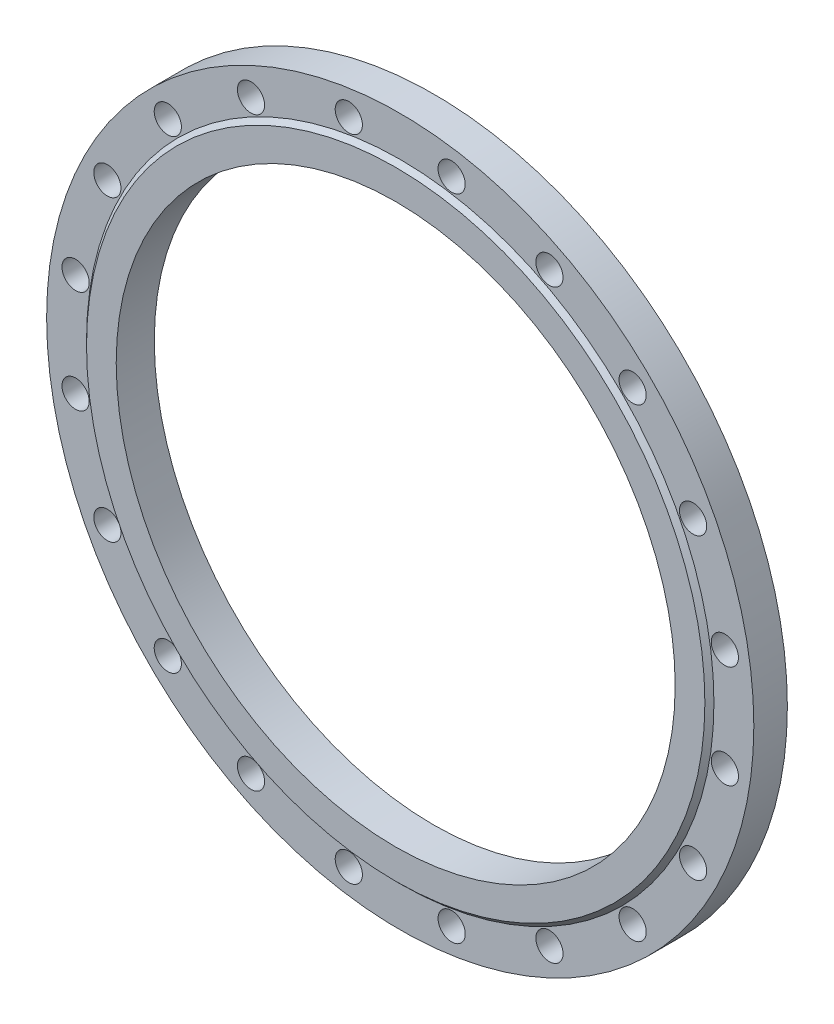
ISO-10303-21;
HEADER;
FILE_DESCRIPTION(('STEP AP214'),'2;1');
FILE_NAME('part.step','',(''),(''),'','','');
FILE_SCHEMA(('AUTOMOTIVE_DESIGN { 1 0 10303 214 1 1 1 1 }'));
ENDSEC;
DATA;
#1=APPLICATION_CONTEXT('core data for automotive mechanical design processes');
#2=APPLICATION_PROTOCOL_DEFINITION('international standard','automotive_design',2000,#1);
#3=PRODUCT_CONTEXT('',#1,'mechanical');
#4=PRODUCT('Part','Part','',(#3));
#5=PRODUCT_RELATED_PRODUCT_CATEGORY('part','',(#4));
#6=PRODUCT_DEFINITION_FORMATION('','',#4);
#7=PRODUCT_DEFINITION_CONTEXT('part definition',#1,'design');
#8=PRODUCT_DEFINITION('design','',#6,#7);
#9=PRODUCT_DEFINITION_SHAPE('','',#8);
#10=(LENGTH_UNIT() NAMED_UNIT(*) SI_UNIT(.MILLI.,.METRE.));
#11=(NAMED_UNIT(*) PLANE_ANGLE_UNIT() SI_UNIT($,.RADIAN.));
#12=(NAMED_UNIT(*) SI_UNIT($,.STERADIAN.) SOLID_ANGLE_UNIT());
#13=UNCERTAINTY_MEASURE_WITH_UNIT(LENGTH_MEASURE(1.E-05),#10,'distance_accuracy_value','');
#14=(GEOMETRIC_REPRESENTATION_CONTEXT(3) GLOBAL_UNCERTAINTY_ASSIGNED_CONTEXT((#13)) GLOBAL_UNIT_ASSIGNED_CONTEXT((#10,
#11,#12)) REPRESENTATION_CONTEXT('',''));
#15=CARTESIAN_POINT('',(0.,0.,0.));
#16=DIRECTION('',(0.,0.,1.));
#17=DIRECTION('',(1.,0.,0.));
#18=AXIS2_PLACEMENT_3D('',#15,#16,#17);
#19=CARTESIAN_POINT('',(0.,390.,-29.));
#20=DIRECTION('',(0.,0.,-1.));
#21=DIRECTION('',(-1.,0.,0.));
#22=AXIS2_PLACEMENT_3D('',#19,#20,#21);
#23=PLANE('',#22);
#24=CARTESIAN_POINT('',(322.989865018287,164.571556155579,-29.));
#25=DIRECTION('',(0.,0.,1.));
#26=DIRECTION('',(1.,0.,0.));
#27=AXIS2_PLACEMENT_3D('',#24,#25,#26);
#28=CIRCLE('',#27,15.0000000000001);
#29=CARTESIAN_POINT('',(337.989865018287,164.571556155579,-29.));
#30=VERTEX_POINT('',#29);
#31=EDGE_CURVE('E166',#30,#30,#28,.T.);
#32=ORIENTED_EDGE('',*,*,#31,.T.);
#33=EDGE_LOOP('',(#32));
#34=FACE_BOUND('',#33,.T.);
#35=CARTESIAN_POINT('',(256.326208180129,256.326208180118,-29.));
#36=DIRECTION('',(0.,0.,1.));
#37=DIRECTION('',(1.,0.,0.));
#38=AXIS2_PLACEMENT_3D('',#35,#36,#37);
#39=CIRCLE('',#38,15.);
#40=CARTESIAN_POINT('',(271.326208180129,256.326208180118,-29.));
#41=VERTEX_POINT('',#40);
#42=EDGE_CURVE('E160',#41,#41,#39,.T.);
#43=ORIENTED_EDGE('',*,*,#42,.T.);
#44=EDGE_LOOP('',(#43));
#45=FACE_BOUND('',#44,.T.);
#46=CARTESIAN_POINT('',(164.571556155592,322.98986501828,-29.));
#47=DIRECTION('',(0.,0.,1.));
#48=DIRECTION('',(1.,0.,0.));
#49=AXIS2_PLACEMENT_3D('',#46,#47,#48);
#50=CIRCLE('',#49,15.);
#51=CARTESIAN_POINT('',(179.571556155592,322.98986501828,-29.));
#52=VERTEX_POINT('',#51);
#53=EDGE_CURVE('E154',#52,#52,#50,.T.);
#54=ORIENTED_EDGE('',*,*,#53,.T.);
#55=EDGE_LOOP('',(#54));
#56=FACE_BOUND('',#55,.T.);
#57=CARTESIAN_POINT('',(56.7074935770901,358.037023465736,-29.));
#58=DIRECTION('',(0.,0.,1.));
#59=DIRECTION('',(1.,0.,0.));
#60=AXIS2_PLACEMENT_3D('',#57,#58,#59);
#61=CIRCLE('',#60,15.);
#62=CARTESIAN_POINT('',(71.7074935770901,358.037023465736,-29.));
#63=VERTEX_POINT('',#62);
#64=EDGE_CURVE('E148',#63,#63,#61,.T.);
#65=ORIENTED_EDGE('',*,*,#64,.T.);
#66=EDGE_LOOP('',(#65));
#67=FACE_BOUND('',#66,.T.);
#68=CARTESIAN_POINT('',(-56.7074935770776,358.037023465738,-29.));
#69=DIRECTION('',(0.,0.,1.));
#70=DIRECTION('',(1.,0.,0.));
#71=AXIS2_PLACEMENT_3D('',#68,#69,#70);
#72=CIRCLE('',#71,15.);
#73=CARTESIAN_POINT('',(-41.7074935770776,358.037023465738,-29.));
#74=VERTEX_POINT('',#73);
#75=EDGE_CURVE('E142',#74,#74,#72,.T.);
#76=ORIENTED_EDGE('',*,*,#75,.T.);
#77=EDGE_LOOP('',(#76));
#78=FACE_BOUND('',#77,.T.);
#79=CARTESIAN_POINT('',(-164.571556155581,322.989865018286,-29.));
#80=DIRECTION('',(0.,0.,1.));
#81=DIRECTION('',(1.,0.,0.));
#82=AXIS2_PLACEMENT_3D('',#79,#80,#81);
#83=CIRCLE('',#82,15.);
#84=CARTESIAN_POINT('',(-149.571556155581,322.989865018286,-29.));
#85=VERTEX_POINT('',#84);
#86=EDGE_CURVE('E136',#85,#85,#83,.T.);
#87=ORIENTED_EDGE('',*,*,#86,.T.);
#88=EDGE_LOOP('',(#87));
#89=FACE_BOUND('',#88,.T.);
#90=CARTESIAN_POINT('',(-256.326208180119,256.326208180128,-29.));
#91=DIRECTION('',(0.,0.,1.));
#92=DIRECTION('',(1.,0.,0.));
#93=AXIS2_PLACEMENT_3D('',#90,#91,#92);
#94=CIRCLE('',#93,15.);
#95=CARTESIAN_POINT('',(-241.326208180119,256.326208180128,-29.));
#96=VERTEX_POINT('',#95);
#97=EDGE_CURVE('E130',#96,#96,#94,.T.);
#98=ORIENTED_EDGE('',*,*,#97,.T.);
#99=EDGE_LOOP('',(#98));
#100=FACE_BOUND('',#99,.T.);
#101=CARTESIAN_POINT('',(-322.989865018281,164.571556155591,-29.));
#102=DIRECTION('',(0.,0.,1.));
#103=DIRECTION('',(1.,0.,0.));
#104=AXIS2_PLACEMENT_3D('',#101,#102,#103);
#105=CIRCLE('',#104,15.);
#106=CARTESIAN_POINT('',(-307.989865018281,164.571556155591,-29.));
#107=VERTEX_POINT('',#106);
#108=EDGE_CURVE('E124',#107,#107,#105,.T.);
#109=ORIENTED_EDGE('',*,*,#108,.T.);
#110=EDGE_LOOP('',(#109));
#111=FACE_BOUND('',#110,.T.);
#112=CARTESIAN_POINT('',(-358.037023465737,56.7074935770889,-29.));
#113=DIRECTION('',(0.,0.,1.));
#114=DIRECTION('',(1.,0.,0.));
#115=AXIS2_PLACEMENT_3D('',#112,#113,#114);
#116=CIRCLE('',#115,15.0000000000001);
#117=CARTESIAN_POINT('',(-343.037023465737,56.7074935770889,-29.));
#118=VERTEX_POINT('',#117);
#119=EDGE_CURVE('E118',#118,#118,#116,.T.);
#120=ORIENTED_EDGE('',*,*,#119,.T.);
#121=EDGE_LOOP('',(#120));
#122=FACE_BOUND('',#121,.T.);
#123=CARTESIAN_POINT('',(-358.037023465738,-56.7074935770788,-29.));
#124=DIRECTION('',(0.,0.,1.));
#125=DIRECTION('',(1.,0.,0.));
#126=AXIS2_PLACEMENT_3D('',#123,#124,#125);
#127=CIRCLE('',#126,15.);
#128=CARTESIAN_POINT('',(-343.037023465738,-56.7074935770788,-29.));
#129=VERTEX_POINT('',#128);
#130=EDGE_CURVE('E112',#129,#129,#127,.T.);
#131=ORIENTED_EDGE('',*,*,#130,.T.);
#132=EDGE_LOOP('',(#131));
#133=FACE_BOUND('',#132,.T.);
#134=CARTESIAN_POINT('',(-322.989865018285,-164.571556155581,-29.));
#135=DIRECTION('',(0.,0.,1.));
#136=DIRECTION('',(1.,0.,0.));
#137=AXIS2_PLACEMENT_3D('',#134,#135,#136);
#138=CIRCLE('',#137,15.);
#139=CARTESIAN_POINT('',(-307.989865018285,-164.571556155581,-29.));
#140=VERTEX_POINT('',#139);
#141=EDGE_CURVE('E106',#140,#140,#138,.T.);
#142=ORIENTED_EDGE('',*,*,#141,.T.);
#143=EDGE_LOOP('',(#142));
#144=FACE_BOUND('',#143,.T.);
#145=CARTESIAN_POINT('',(-256.326208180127,-256.32620818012,-29.));
#146=DIRECTION('',(0.,0.,1.));
#147=DIRECTION('',(1.,0.,0.));
#148=AXIS2_PLACEMENT_3D('',#145,#146,#147);
#149=CIRCLE('',#148,15.);
#150=CARTESIAN_POINT('',(-241.326208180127,-256.32620818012,-29.));
#151=VERTEX_POINT('',#150);
#152=EDGE_CURVE('E100',#151,#151,#149,.T.);
#153=ORIENTED_EDGE('',*,*,#152,.T.);
#154=EDGE_LOOP('',(#153));
#155=FACE_BOUND('',#154,.T.);
#156=CARTESIAN_POINT('',(-164.571556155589,-322.989865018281,-29.));
#157=DIRECTION('',(0.,0.,1.));
#158=DIRECTION('',(1.,0.,0.));
#159=AXIS2_PLACEMENT_3D('',#156,#157,#158);
#160=CIRCLE('',#159,15.);
#161=CARTESIAN_POINT('',(-149.571556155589,-322.989865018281,-29.));
#162=VERTEX_POINT('',#161);
#163=EDGE_CURVE('E94',#162,#162,#160,.T.);
#164=ORIENTED_EDGE('',*,*,#163,.T.);
#165=EDGE_LOOP('',(#164));
#166=FACE_BOUND('',#165,.T.);
#167=CARTESIAN_POINT('',(-56.7074935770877,-358.037023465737,-29.));
#168=DIRECTION('',(0.,0.,1.));
#169=DIRECTION('',(1.,0.,0.));
#170=AXIS2_PLACEMENT_3D('',#167,#168,#169);
#171=CIRCLE('',#170,15.);
#172=CARTESIAN_POINT('',(-41.7074935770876,-358.037023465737,-29.));
#173=VERTEX_POINT('',#172);
#174=EDGE_CURVE('E88',#173,#173,#171,.T.);
#175=ORIENTED_EDGE('',*,*,#174,.T.);
#176=EDGE_LOOP('',(#175));
#177=FACE_BOUND('',#176,.T.);
#178=CARTESIAN_POINT('',(56.7074935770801,-358.037023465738,-29.));
#179=DIRECTION('',(0.,0.,1.));
#180=DIRECTION('',(1.,0.,0.));
#181=AXIS2_PLACEMENT_3D('',#178,#179,#180);
#182=CIRCLE('',#181,15.);
#183=CARTESIAN_POINT('',(71.7074935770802,-358.037023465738,-29.));
#184=VERTEX_POINT('',#183);
#185=EDGE_CURVE('E82',#184,#184,#182,.T.);
#186=ORIENTED_EDGE('',*,*,#185,.T.);
#187=EDGE_LOOP('',(#186));
#188=FACE_BOUND('',#187,.T.);
#189=CARTESIAN_POINT('',(164.571556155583,-322.989865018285,-29.));
#190=DIRECTION('',(0.,0.,1.));
#191=DIRECTION('',(1.,0.,0.));
#192=AXIS2_PLACEMENT_3D('',#189,#190,#191);
#193=CIRCLE('',#192,15.);
#194=CARTESIAN_POINT('',(179.571556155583,-322.989865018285,-29.));
#195=VERTEX_POINT('',#194);
#196=EDGE_CURVE('E76',#195,#195,#193,.T.);
#197=ORIENTED_EDGE('',*,*,#196,.T.);
#198=EDGE_LOOP('',(#197));
#199=FACE_BOUND('',#198,.T.);
#200=CARTESIAN_POINT('',(256.326208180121,-256.326208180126,-29.));
#201=DIRECTION('',(0.,0.,1.));
#202=DIRECTION('',(1.,0.,0.));
#203=AXIS2_PLACEMENT_3D('',#200,#201,#202);
#204=CIRCLE('',#203,15.0000000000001);
#205=CARTESIAN_POINT('',(271.326208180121,-256.326208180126,-29.));
#206=VERTEX_POINT('',#205);
#207=EDGE_CURVE('E70',#206,#206,#204,.T.);
#208=ORIENTED_EDGE('',*,*,#207,.T.);
#209=EDGE_LOOP('',(#208));
#210=FACE_BOUND('',#209,.T.);
#211=CARTESIAN_POINT('',(322.989865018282,-164.571556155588,-29.));
#212=DIRECTION('',(0.,0.,1.));
#213=DIRECTION('',(1.,0.,0.));
#214=AXIS2_PLACEMENT_3D('',#211,#212,#213);
#215=CIRCLE('',#214,15.);
#216=CARTESIAN_POINT('',(337.989865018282,-164.571556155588,-29.));
#217=VERTEX_POINT('',#216);
#218=EDGE_CURVE('E64',#217,#217,#215,.T.);
#219=ORIENTED_EDGE('',*,*,#218,.T.);
#220=EDGE_LOOP('',(#219));
#221=FACE_BOUND('',#220,.T.);
#222=CARTESIAN_POINT('',(358.037023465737,-56.7074935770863,-29.));
#223=DIRECTION('',(0.,0.,1.));
#224=DIRECTION('',(1.,0.,0.));
#225=AXIS2_PLACEMENT_3D('',#222,#223,#224);
#226=CIRCLE('',#225,15.);
#227=CARTESIAN_POINT('',(373.037023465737,-56.7074935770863,-29.));
#228=VERTEX_POINT('',#227);
#229=EDGE_CURVE('E58',#228,#228,#226,.T.);
#230=ORIENTED_EDGE('',*,*,#229,.T.);
#231=EDGE_LOOP('',(#230));
#232=FACE_BOUND('',#231,.T.);
#233=CARTESIAN_POINT('',(358.037023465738,56.7074935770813,-29.));
#234=DIRECTION('',(0.,0.,1.));
#235=DIRECTION('',(1.,0.,0.));
#236=AXIS2_PLACEMENT_3D('',#233,#234,#235);
#237=CIRCLE('',#236,15.);
#238=CARTESIAN_POINT('',(373.037023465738,56.7074935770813,-29.));
#239=VERTEX_POINT('',#238);
#240=EDGE_CURVE('E54',#239,#239,#237,.T.);
#241=ORIENTED_EDGE('',*,*,#240,.T.);
#242=EDGE_LOOP('',(#241));
#243=FACE_BOUND('',#242,.T.);
#244=CARTESIAN_POINT('',(0.,0.,-29.));
#245=DIRECTION('',(0.,0.,-1.));
#246=DIRECTION('',(-1.,0.,0.));
#247=AXIS2_PLACEMENT_3D('',#244,#245,#246);
#248=CIRCLE('',#247,390.);
#249=CARTESIAN_POINT('',(-390.,0.,-29.));
#250=VERTEX_POINT('',#249);
#251=EDGE_CURVE('E10',#250,#250,#248,.T.);
#252=ORIENTED_EDGE('',*,*,#251,.T.);
#253=EDGE_LOOP('',(#252));
#254=FACE_BOUND('',#253,.T.);
#255=CARTESIAN_POINT('',(0.,0.,-29.));
#256=DIRECTION('',(0.,0.,-1.));
#257=DIRECTION('',(-1.,0.,0.));
#258=AXIS2_PLACEMENT_3D('',#255,#256,#257);
#259=CIRCLE('',#258,308.25);
#260=CARTESIAN_POINT('',(-308.25,0.,-29.));
#261=VERTEX_POINT('',#260);
#262=EDGE_CURVE('E51',#261,#261,#259,.T.);
#263=ORIENTED_EDGE('',*,*,#262,.F.);
#264=EDGE_LOOP('',(#263));
#265=FACE_BOUND('',#264,.T.);
#266=ADVANCED_FACE('F29',(#34,#45,#56,#67,#78,#89,#100,#111,#122,#133,#144,#155,#166,#177,#188,
#199,#210,#221,#232,#243,#254,#265),#23,.T.);
#267=CARTESIAN_POINT('',(0.,0.,0.));
#268=DIRECTION('',(0.,0.,-1.));
#269=DIRECTION('',(-1.,0.,0.));
#270=AXIS2_PLACEMENT_3D('',#267,#268,#269);
#271=CYLINDRICAL_SURFACE('',#270,390.);
#272=CARTESIAN_POINT('',(0.,0.,7.99999999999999));
#273=DIRECTION('',(0.,0.,-1.));
#274=DIRECTION('',(-1.,0.,0.));
#275=AXIS2_PLACEMENT_3D('',#272,#273,#274);
#276=CIRCLE('',#275,390.);
#277=CARTESIAN_POINT('',(-390.,0.,7.99999999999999));
#278=VERTEX_POINT('',#277);
#279=EDGE_CURVE('E35',#278,#278,#276,.T.);
#280=ORIENTED_EDGE('',*,*,#279,.T.);
#281=EDGE_LOOP('',(#280));
#282=FACE_BOUND('',#281,.T.);
#283=ORIENTED_EDGE('',*,*,#251,.F.);
#284=EDGE_LOOP('',(#283));
#285=FACE_BOUND('',#284,.T.);
#286=ADVANCED_FACE('F188',(#282,#285),#271,.T.);
#287=CARTESIAN_POINT('',(0.,346.,7.99999999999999));
#288=DIRECTION('',(0.,0.,1.));
#289=DIRECTION('',(1.,0.,0.));
#290=AXIS2_PLACEMENT_3D('',#287,#288,#289);
#291=PLANE('',#290);
#292=CARTESIAN_POINT('',(322.989865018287,164.571556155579,7.99999999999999));
#293=DIRECTION('',(0.,0.,1.));
#294=DIRECTION('',(1.,0.,0.));
#295=AXIS2_PLACEMENT_3D('',#292,#293,#294);
#296=CIRCLE('',#295,15.0000000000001);
#297=CARTESIAN_POINT('',(337.989865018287,164.571556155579,7.99999999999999));
#298=VERTEX_POINT('',#297);
#299=EDGE_CURVE('E169',#298,#298,#296,.T.);
#300=ORIENTED_EDGE('',*,*,#299,.F.);
#301=EDGE_LOOP('',(#300));
#302=FACE_BOUND('',#301,.T.);
#303=CARTESIAN_POINT('',(256.326208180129,256.326208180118,7.99999999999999));
#304=DIRECTION('',(0.,0.,1.));
#305=DIRECTION('',(1.,0.,0.));
#306=AXIS2_PLACEMENT_3D('',#303,#304,#305);
#307=CIRCLE('',#306,15.);
#308=CARTESIAN_POINT('',(271.326208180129,256.326208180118,7.99999999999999));
#309=VERTEX_POINT('',#308);
#310=EDGE_CURVE('E163',#309,#309,#307,.T.);
#311=ORIENTED_EDGE('',*,*,#310,.F.);
#312=EDGE_LOOP('',(#311));
#313=FACE_BOUND('',#312,.T.);
#314=CARTESIAN_POINT('',(164.571556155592,322.98986501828,7.99999999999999));
#315=DIRECTION('',(0.,0.,1.));
#316=DIRECTION('',(1.,0.,0.));
#317=AXIS2_PLACEMENT_3D('',#314,#315,#316);
#318=CIRCLE('',#317,15.);
#319=CARTESIAN_POINT('',(179.571556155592,322.98986501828,7.99999999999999));
#320=VERTEX_POINT('',#319);
#321=EDGE_CURVE('E157',#320,#320,#318,.T.);
#322=ORIENTED_EDGE('',*,*,#321,.F.);
#323=EDGE_LOOP('',(#322));
#324=FACE_BOUND('',#323,.T.);
#325=CARTESIAN_POINT('',(56.7074935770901,358.037023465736,7.99999999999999));
#326=DIRECTION('',(0.,0.,1.));
#327=DIRECTION('',(1.,0.,0.));
#328=AXIS2_PLACEMENT_3D('',#325,#326,#327);
#329=CIRCLE('',#328,15.);
#330=CARTESIAN_POINT('',(71.7074935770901,358.037023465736,7.99999999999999));
#331=VERTEX_POINT('',#330);
#332=EDGE_CURVE('E151',#331,#331,#329,.T.);
#333=ORIENTED_EDGE('',*,*,#332,.F.);
#334=EDGE_LOOP('',(#333));
#335=FACE_BOUND('',#334,.T.);
#336=CARTESIAN_POINT('',(-56.7074935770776,358.037023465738,7.99999999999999));
#337=DIRECTION('',(0.,0.,1.));
#338=DIRECTION('',(1.,0.,0.));
#339=AXIS2_PLACEMENT_3D('',#336,#337,#338);
#340=CIRCLE('',#339,15.);
#341=CARTESIAN_POINT('',(-41.7074935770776,358.037023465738,7.99999999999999));
#342=VERTEX_POINT('',#341);
#343=EDGE_CURVE('E145',#342,#342,#340,.T.);
#344=ORIENTED_EDGE('',*,*,#343,.F.);
#345=EDGE_LOOP('',(#344));
#346=FACE_BOUND('',#345,.T.);
#347=CARTESIAN_POINT('',(-164.571556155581,322.989865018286,7.99999999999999));
#348=DIRECTION('',(0.,0.,1.));
#349=DIRECTION('',(1.,0.,0.));
#350=AXIS2_PLACEMENT_3D('',#347,#348,#349);
#351=CIRCLE('',#350,15.);
#352=CARTESIAN_POINT('',(-149.571556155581,322.989865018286,7.99999999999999));
#353=VERTEX_POINT('',#352);
#354=EDGE_CURVE('E139',#353,#353,#351,.T.);
#355=ORIENTED_EDGE('',*,*,#354,.F.);
#356=EDGE_LOOP('',(#355));
#357=FACE_BOUND('',#356,.T.);
#358=CARTESIAN_POINT('',(-256.326208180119,256.326208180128,7.99999999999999));
#359=DIRECTION('',(0.,0.,1.));
#360=DIRECTION('',(1.,0.,0.));
#361=AXIS2_PLACEMENT_3D('',#358,#359,#360);
#362=CIRCLE('',#361,15.);
#363=CARTESIAN_POINT('',(-241.326208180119,256.326208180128,7.99999999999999));
#364=VERTEX_POINT('',#363);
#365=EDGE_CURVE('E133',#364,#364,#362,.T.);
#366=ORIENTED_EDGE('',*,*,#365,.F.);
#367=EDGE_LOOP('',(#366));
#368=FACE_BOUND('',#367,.T.);
#369=CARTESIAN_POINT('',(-322.989865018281,164.571556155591,7.99999999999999));
#370=DIRECTION('',(0.,0.,1.));
#371=DIRECTION('',(1.,0.,0.));
#372=AXIS2_PLACEMENT_3D('',#369,#370,#371);
#373=CIRCLE('',#372,15.);
#374=CARTESIAN_POINT('',(-307.989865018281,164.571556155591,7.99999999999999));
#375=VERTEX_POINT('',#374);
#376=EDGE_CURVE('E127',#375,#375,#373,.T.);
#377=ORIENTED_EDGE('',*,*,#376,.F.);
#378=EDGE_LOOP('',(#377));
#379=FACE_BOUND('',#378,.T.);
#380=CARTESIAN_POINT('',(-358.037023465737,56.7074935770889,7.99999999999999));
#381=DIRECTION('',(0.,0.,1.));
#382=DIRECTION('',(1.,0.,0.));
#383=AXIS2_PLACEMENT_3D('',#380,#381,#382);
#384=CIRCLE('',#383,15.0000000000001);
#385=CARTESIAN_POINT('',(-343.037023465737,56.7074935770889,7.99999999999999));
#386=VERTEX_POINT('',#385);
#387=EDGE_CURVE('E121',#386,#386,#384,.T.);
#388=ORIENTED_EDGE('',*,*,#387,.F.);
#389=EDGE_LOOP('',(#388));
#390=FACE_BOUND('',#389,.T.);
#391=CARTESIAN_POINT('',(-358.037023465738,-56.7074935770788,7.99999999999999));
#392=DIRECTION('',(0.,0.,1.));
#393=DIRECTION('',(1.,0.,0.));
#394=AXIS2_PLACEMENT_3D('',#391,#392,#393);
#395=CIRCLE('',#394,15.);
#396=CARTESIAN_POINT('',(-343.037023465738,-56.7074935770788,7.99999999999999));
#397=VERTEX_POINT('',#396);
#398=EDGE_CURVE('E115',#397,#397,#395,.T.);
#399=ORIENTED_EDGE('',*,*,#398,.F.);
#400=EDGE_LOOP('',(#399));
#401=FACE_BOUND('',#400,.T.);
#402=CARTESIAN_POINT('',(-322.989865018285,-164.571556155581,7.99999999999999));
#403=DIRECTION('',(0.,0.,1.));
#404=DIRECTION('',(1.,0.,0.));
#405=AXIS2_PLACEMENT_3D('',#402,#403,#404);
#406=CIRCLE('',#405,15.);
#407=CARTESIAN_POINT('',(-307.989865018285,-164.571556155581,7.99999999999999));
#408=VERTEX_POINT('',#407);
#409=EDGE_CURVE('E109',#408,#408,#406,.T.);
#410=ORIENTED_EDGE('',*,*,#409,.F.);
#411=EDGE_LOOP('',(#410));
#412=FACE_BOUND('',#411,.T.);
#413=CARTESIAN_POINT('',(-256.326208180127,-256.32620818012,7.99999999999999));
#414=DIRECTION('',(0.,0.,1.));
#415=DIRECTION('',(1.,0.,0.));
#416=AXIS2_PLACEMENT_3D('',#413,#414,#415);
#417=CIRCLE('',#416,15.);
#418=CARTESIAN_POINT('',(-241.326208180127,-256.32620818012,7.99999999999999));
#419=VERTEX_POINT('',#418);
#420=EDGE_CURVE('E103',#419,#419,#417,.T.);
#421=ORIENTED_EDGE('',*,*,#420,.F.);
#422=EDGE_LOOP('',(#421));
#423=FACE_BOUND('',#422,.T.);
#424=CARTESIAN_POINT('',(-164.571556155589,-322.989865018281,7.99999999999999));
#425=DIRECTION('',(0.,0.,1.));
#426=DIRECTION('',(1.,0.,0.));
#427=AXIS2_PLACEMENT_3D('',#424,#425,#426);
#428=CIRCLE('',#427,15.);
#429=CARTESIAN_POINT('',(-149.571556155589,-322.989865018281,7.99999999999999));
#430=VERTEX_POINT('',#429);
#431=EDGE_CURVE('E97',#430,#430,#428,.T.);
#432=ORIENTED_EDGE('',*,*,#431,.F.);
#433=EDGE_LOOP('',(#432));
#434=FACE_BOUND('',#433,.T.);
#435=CARTESIAN_POINT('',(-56.7074935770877,-358.037023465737,7.99999999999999));
#436=DIRECTION('',(0.,0.,1.));
#437=DIRECTION('',(1.,0.,0.));
#438=AXIS2_PLACEMENT_3D('',#435,#436,#437);
#439=CIRCLE('',#438,15.);
#440=CARTESIAN_POINT('',(-41.7074935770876,-358.037023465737,7.99999999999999));
#441=VERTEX_POINT('',#440);
#442=EDGE_CURVE('E91',#441,#441,#439,.T.);
#443=ORIENTED_EDGE('',*,*,#442,.F.);
#444=EDGE_LOOP('',(#443));
#445=FACE_BOUND('',#444,.T.);
#446=CARTESIAN_POINT('',(56.7074935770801,-358.037023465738,7.99999999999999));
#447=DIRECTION('',(0.,0.,1.));
#448=DIRECTION('',(1.,0.,0.));
#449=AXIS2_PLACEMENT_3D('',#446,#447,#448);
#450=CIRCLE('',#449,15.);
#451=CARTESIAN_POINT('',(71.7074935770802,-358.037023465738,7.99999999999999));
#452=VERTEX_POINT('',#451);
#453=EDGE_CURVE('E85',#452,#452,#450,.T.);
#454=ORIENTED_EDGE('',*,*,#453,.F.);
#455=EDGE_LOOP('',(#454));
#456=FACE_BOUND('',#455,.T.);
#457=CARTESIAN_POINT('',(164.571556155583,-322.989865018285,7.99999999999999));
#458=DIRECTION('',(0.,0.,1.));
#459=DIRECTION('',(1.,0.,0.));
#460=AXIS2_PLACEMENT_3D('',#457,#458,#459);
#461=CIRCLE('',#460,15.);
#462=CARTESIAN_POINT('',(179.571556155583,-322.989865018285,7.99999999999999));
#463=VERTEX_POINT('',#462);
#464=EDGE_CURVE('E79',#463,#463,#461,.T.);
#465=ORIENTED_EDGE('',*,*,#464,.F.);
#466=EDGE_LOOP('',(#465));
#467=FACE_BOUND('',#466,.T.);
#468=CARTESIAN_POINT('',(256.326208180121,-256.326208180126,7.99999999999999));
#469=DIRECTION('',(0.,0.,1.));
#470=DIRECTION('',(1.,0.,0.));
#471=AXIS2_PLACEMENT_3D('',#468,#469,#470);
#472=CIRCLE('',#471,15.0000000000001);
#473=CARTESIAN_POINT('',(271.326208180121,-256.326208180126,7.99999999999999));
#474=VERTEX_POINT('',#473);
#475=EDGE_CURVE('E73',#474,#474,#472,.T.);
#476=ORIENTED_EDGE('',*,*,#475,.F.);
#477=EDGE_LOOP('',(#476));
#478=FACE_BOUND('',#477,.T.);
#479=CARTESIAN_POINT('',(322.989865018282,-164.571556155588,7.99999999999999));
#480=DIRECTION('',(0.,0.,1.));
#481=DIRECTION('',(1.,0.,0.));
#482=AXIS2_PLACEMENT_3D('',#479,#480,#481);
#483=CIRCLE('',#482,15.);
#484=CARTESIAN_POINT('',(337.989865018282,-164.571556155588,7.99999999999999));
#485=VERTEX_POINT('',#484);
#486=EDGE_CURVE('E67',#485,#485,#483,.T.);
#487=ORIENTED_EDGE('',*,*,#486,.F.);
#488=EDGE_LOOP('',(#487));
#489=FACE_BOUND('',#488,.T.);
#490=CARTESIAN_POINT('',(358.037023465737,-56.7074935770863,7.99999999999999));
#491=DIRECTION('',(0.,0.,1.));
#492=DIRECTION('',(1.,0.,0.));
#493=AXIS2_PLACEMENT_3D('',#490,#491,#492);
#494=CIRCLE('',#493,15.);
#495=CARTESIAN_POINT('',(373.037023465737,-56.7074935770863,7.99999999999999));
#496=VERTEX_POINT('',#495);
#497=EDGE_CURVE('E61',#496,#496,#494,.T.);
#498=ORIENTED_EDGE('',*,*,#497,.F.);
#499=EDGE_LOOP('',(#498));
#500=FACE_BOUND('',#499,.T.);
#501=CARTESIAN_POINT('',(358.037023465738,56.7074935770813,7.99999999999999));
#502=DIRECTION('',(0.,0.,1.));
#503=DIRECTION('',(1.,0.,0.));
#504=AXIS2_PLACEMENT_3D('',#501,#502,#503);
#505=CIRCLE('',#504,15.);
#506=CARTESIAN_POINT('',(373.037023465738,56.7074935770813,7.99999999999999));
#507=VERTEX_POINT('',#506);
#508=EDGE_CURVE('E55',#507,#507,#505,.T.);
#509=ORIENTED_EDGE('',*,*,#508,.F.);
#510=EDGE_LOOP('',(#509));
#511=FACE_BOUND('',#510,.T.);
#512=CARTESIAN_POINT('',(0.,0.,7.99999999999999));
#513=DIRECTION('',(0.,0.,-1.));
#514=DIRECTION('',(-1.,0.,0.));
#515=AXIS2_PLACEMENT_3D('',#512,#513,#514);
#516=CIRCLE('',#515,346.);
#517=CARTESIAN_POINT('',(-346.,0.,7.99999999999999));
#518=VERTEX_POINT('',#517);
#519=EDGE_CURVE('E39',#518,#518,#516,.T.);
#520=ORIENTED_EDGE('',*,*,#519,.T.);
#521=EDGE_LOOP('',(#520));
#522=FACE_BOUND('',#521,.T.);
#523=ORIENTED_EDGE('',*,*,#279,.F.);
#524=EDGE_LOOP('',(#523));
#525=FACE_BOUND('',#524,.T.);
#526=ADVANCED_FACE('F184',(#302,#313,#324,#335,#346,#357,#368,#379,#390,#401,#412,#423,#434,
#445,#456,#467,#478,#489,#500,#511,#522,#525),#291,.T.);
#527=CARTESIAN_POINT('',(0.,0.,7.99999999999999));
#528=DIRECTION('',(0.,0.,-1.));
#529=DIRECTION('',(-1.,0.,0.));
#530=AXIS2_PLACEMENT_3D('',#527,#528,#529);
#531=CONICAL_SURFACE('',#530,346.,0.785398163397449);
#532=CARTESIAN_POINT('',(0.,0.,13.));
#533=DIRECTION('',(0.,0.,-1.));
#534=DIRECTION('',(-1.,0.,0.));
#535=AXIS2_PLACEMENT_3D('',#532,#533,#534);
#536=CIRCLE('',#535,341.);
#537=CARTESIAN_POINT('',(-341.,0.,13.));
#538=VERTEX_POINT('',#537);
#539=EDGE_CURVE('E43',#538,#538,#536,.T.);
#540=ORIENTED_EDGE('',*,*,#539,.T.);
#541=EDGE_LOOP('',(#540));
#542=FACE_BOUND('',#541,.T.);
#543=ORIENTED_EDGE('',*,*,#519,.F.);
#544=EDGE_LOOP('',(#543));
#545=FACE_BOUND('',#544,.T.);
#546=ADVANCED_FACE('F187',(#542,#545),#531,.T.);
#547=CARTESIAN_POINT('',(0.,341.,13.));
#548=DIRECTION('',(0.,0.,1.));
#549=DIRECTION('',(1.,0.,0.));
#550=AXIS2_PLACEMENT_3D('',#547,#548,#549);
#551=PLANE('',#550);
#552=CARTESIAN_POINT('',(0.,0.,13.));
#553=DIRECTION('',(0.,0.,-1.));
#554=DIRECTION('',(-1.,0.,0.));
#555=AXIS2_PLACEMENT_3D('',#552,#553,#554);
#556=CIRCLE('',#555,308.25);
#557=CARTESIAN_POINT('',(-308.25,0.,13.));
#558=VERTEX_POINT('',#557);
#559=EDGE_CURVE('E48',#558,#558,#556,.T.);
#560=ORIENTED_EDGE('',*,*,#559,.T.);
#561=EDGE_LOOP('',(#560));
#562=FACE_BOUND('',#561,.T.);
#563=ORIENTED_EDGE('',*,*,#539,.F.);
#564=EDGE_LOOP('',(#563));
#565=FACE_BOUND('',#564,.T.);
#566=ADVANCED_FACE('F232',(#562,#565),#551,.T.);
#567=CARTESIAN_POINT('',(0.,0.,0.));
#568=DIRECTION('',(0.,0.,-1.));
#569=DIRECTION('',(-1.,0.,0.));
#570=AXIS2_PLACEMENT_3D('',#567,#568,#569);
#571=CYLINDRICAL_SURFACE('',#570,308.25);
#572=ORIENTED_EDGE('',*,*,#262,.T.);
#573=EDGE_LOOP('',(#572));
#574=FACE_BOUND('',#573,.T.);
#575=ORIENTED_EDGE('',*,*,#559,.F.);
#576=EDGE_LOOP('',(#575));
#577=FACE_BOUND('',#576,.T.);
#578=ADVANCED_FACE('F238',(#574,#577),#571,.F.);
#579=CARTESIAN_POINT('',(358.037023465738,56.7074935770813,-29.));
#580=DIRECTION('',(0.,0.,1.));
#581=DIRECTION('',(1.,0.,0.));
#582=AXIS2_PLACEMENT_3D('',#579,#580,#581);
#583=CYLINDRICAL_SURFACE('',#582,15.);
#584=ORIENTED_EDGE('',*,*,#240,.F.);
#585=EDGE_LOOP('',(#584));
#586=FACE_BOUND('',#585,.T.);
#587=ORIENTED_EDGE('',*,*,#508,.T.);
#588=EDGE_LOOP('',(#587));
#589=FACE_BOUND('',#588,.T.);
#590=ADVANCED_FACE('F261',(#586,#589),#583,.F.);
#591=CARTESIAN_POINT('',(358.037023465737,-56.7074935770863,-29.));
#592=DIRECTION('',(0.,0.,1.));
#593=DIRECTION('',(1.,0.,0.));
#594=AXIS2_PLACEMENT_3D('',#591,#592,#593);
#595=CYLINDRICAL_SURFACE('',#594,15.);
#596=ORIENTED_EDGE('',*,*,#229,.F.);
#597=EDGE_LOOP('',(#596));
#598=FACE_BOUND('',#597,.T.);
#599=ORIENTED_EDGE('',*,*,#497,.T.);
#600=EDGE_LOOP('',(#599));
#601=FACE_BOUND('',#600,.T.);
#602=ADVANCED_FACE('F266',(#598,#601),#595,.F.);
#603=CARTESIAN_POINT('',(322.989865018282,-164.571556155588,-29.));
#604=DIRECTION('',(0.,0.,1.));
#605=DIRECTION('',(1.,0.,0.));
#606=AXIS2_PLACEMENT_3D('',#603,#604,#605);
#607=CYLINDRICAL_SURFACE('',#606,15.);
#608=ORIENTED_EDGE('',*,*,#218,.F.);
#609=EDGE_LOOP('',(#608));
#610=FACE_BOUND('',#609,.T.);
#611=ORIENTED_EDGE('',*,*,#486,.T.);
#612=EDGE_LOOP('',(#611));
#613=FACE_BOUND('',#612,.T.);
#614=ADVANCED_FACE('F278',(#610,#613),#607,.F.);
#615=CARTESIAN_POINT('',(256.326208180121,-256.326208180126,-29.));
#616=DIRECTION('',(0.,0.,1.));
#617=DIRECTION('',(1.,0.,0.));
#618=AXIS2_PLACEMENT_3D('',#615,#616,#617);
#619=CYLINDRICAL_SURFACE('',#618,15.0000000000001);
#620=ORIENTED_EDGE('',*,*,#207,.F.);
#621=EDGE_LOOP('',(#620));
#622=FACE_BOUND('',#621,.T.);
#623=ORIENTED_EDGE('',*,*,#475,.T.);
#624=EDGE_LOOP('',(#623));
#625=FACE_BOUND('',#624,.T.);
#626=ADVANCED_FACE('F288',(#622,#625),#619,.F.);
#627=CARTESIAN_POINT('',(164.571556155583,-322.989865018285,-29.));
#628=DIRECTION('',(0.,0.,1.));
#629=DIRECTION('',(1.,0.,0.));
#630=AXIS2_PLACEMENT_3D('',#627,#628,#629);
#631=CYLINDRICAL_SURFACE('',#630,15.);
#632=ORIENTED_EDGE('',*,*,#196,.F.);
#633=EDGE_LOOP('',(#632));
#634=FACE_BOUND('',#633,.T.);
#635=ORIENTED_EDGE('',*,*,#464,.T.);
#636=EDGE_LOOP('',(#635));
#637=FACE_BOUND('',#636,.T.);
#638=ADVANCED_FACE('F298',(#634,#637),#631,.F.);
#639=CARTESIAN_POINT('',(56.7074935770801,-358.037023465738,-29.));
#640=DIRECTION('',(0.,0.,1.));
#641=DIRECTION('',(1.,0.,0.));
#642=AXIS2_PLACEMENT_3D('',#639,#640,#641);
#643=CYLINDRICAL_SURFACE('',#642,15.);
#644=ORIENTED_EDGE('',*,*,#185,.F.);
#645=EDGE_LOOP('',(#644));
#646=FACE_BOUND('',#645,.T.);
#647=ORIENTED_EDGE('',*,*,#453,.T.);
#648=EDGE_LOOP('',(#647));
#649=FACE_BOUND('',#648,.T.);
#650=ADVANCED_FACE('F308',(#646,#649),#643,.F.);
#651=CARTESIAN_POINT('',(-56.7074935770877,-358.037023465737,-29.));
#652=DIRECTION('',(0.,0.,1.));
#653=DIRECTION('',(1.,0.,0.));
#654=AXIS2_PLACEMENT_3D('',#651,#652,#653);
#655=CYLINDRICAL_SURFACE('',#654,15.);
#656=ORIENTED_EDGE('',*,*,#174,.F.);
#657=EDGE_LOOP('',(#656));
#658=FACE_BOUND('',#657,.T.);
#659=ORIENTED_EDGE('',*,*,#442,.T.);
#660=EDGE_LOOP('',(#659));
#661=FACE_BOUND('',#660,.T.);
#662=ADVANCED_FACE('F318',(#658,#661),#655,.F.);
#663=CARTESIAN_POINT('',(-164.571556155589,-322.989865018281,-29.));
#664=DIRECTION('',(0.,0.,1.));
#665=DIRECTION('',(1.,0.,0.));
#666=AXIS2_PLACEMENT_3D('',#663,#664,#665);
#667=CYLINDRICAL_SURFACE('',#666,15.);
#668=ORIENTED_EDGE('',*,*,#163,.F.);
#669=EDGE_LOOP('',(#668));
#670=FACE_BOUND('',#669,.T.);
#671=ORIENTED_EDGE('',*,*,#431,.T.);
#672=EDGE_LOOP('',(#671));
#673=FACE_BOUND('',#672,.T.);
#674=ADVANCED_FACE('F328',(#670,#673),#667,.F.);
#675=CARTESIAN_POINT('',(-256.326208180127,-256.32620818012,-29.));
#676=DIRECTION('',(0.,0.,1.));
#677=DIRECTION('',(1.,0.,0.));
#678=AXIS2_PLACEMENT_3D('',#675,#676,#677);
#679=CYLINDRICAL_SURFACE('',#678,15.);
#680=ORIENTED_EDGE('',*,*,#152,.F.);
#681=EDGE_LOOP('',(#680));
#682=FACE_BOUND('',#681,.T.);
#683=ORIENTED_EDGE('',*,*,#420,.T.);
#684=EDGE_LOOP('',(#683));
#685=FACE_BOUND('',#684,.T.);
#686=ADVANCED_FACE('F338',(#682,#685),#679,.F.);
#687=CARTESIAN_POINT('',(-322.989865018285,-164.571556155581,-29.));
#688=DIRECTION('',(0.,0.,1.));
#689=DIRECTION('',(1.,0.,0.));
#690=AXIS2_PLACEMENT_3D('',#687,#688,#689);
#691=CYLINDRICAL_SURFACE('',#690,15.);
#692=ORIENTED_EDGE('',*,*,#141,.F.);
#693=EDGE_LOOP('',(#692));
#694=FACE_BOUND('',#693,.T.);
#695=ORIENTED_EDGE('',*,*,#409,.T.);
#696=EDGE_LOOP('',(#695));
#697=FACE_BOUND('',#696,.T.);
#698=ADVANCED_FACE('F348',(#694,#697),#691,.F.);
#699=CARTESIAN_POINT('',(-358.037023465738,-56.7074935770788,-29.));
#700=DIRECTION('',(0.,0.,1.));
#701=DIRECTION('',(1.,0.,0.));
#702=AXIS2_PLACEMENT_3D('',#699,#700,#701);
#703=CYLINDRICAL_SURFACE('',#702,15.);
#704=ORIENTED_EDGE('',*,*,#130,.F.);
#705=EDGE_LOOP('',(#704));
#706=FACE_BOUND('',#705,.T.);
#707=ORIENTED_EDGE('',*,*,#398,.T.);
#708=EDGE_LOOP('',(#707));
#709=FACE_BOUND('',#708,.T.);
#710=ADVANCED_FACE('F358',(#706,#709),#703,.F.);
#711=CARTESIAN_POINT('',(-358.037023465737,56.7074935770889,-29.));
#712=DIRECTION('',(0.,0.,1.));
#713=DIRECTION('',(1.,0.,0.));
#714=AXIS2_PLACEMENT_3D('',#711,#712,#713);
#715=CYLINDRICAL_SURFACE('',#714,15.0000000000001);
#716=ORIENTED_EDGE('',*,*,#119,.F.);
#717=EDGE_LOOP('',(#716));
#718=FACE_BOUND('',#717,.T.);
#719=ORIENTED_EDGE('',*,*,#387,.T.);
#720=EDGE_LOOP('',(#719));
#721=FACE_BOUND('',#720,.T.);
#722=ADVANCED_FACE('F368',(#718,#721),#715,.F.);
#723=CARTESIAN_POINT('',(-322.989865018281,164.571556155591,-29.));
#724=DIRECTION('',(0.,0.,1.));
#725=DIRECTION('',(1.,0.,0.));
#726=AXIS2_PLACEMENT_3D('',#723,#724,#725);
#727=CYLINDRICAL_SURFACE('',#726,15.);
#728=ORIENTED_EDGE('',*,*,#108,.F.);
#729=EDGE_LOOP('',(#728));
#730=FACE_BOUND('',#729,.T.);
#731=ORIENTED_EDGE('',*,*,#376,.T.);
#732=EDGE_LOOP('',(#731));
#733=FACE_BOUND('',#732,.T.);
#734=ADVANCED_FACE('F378',(#730,#733),#727,.F.);
#735=CARTESIAN_POINT('',(-256.326208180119,256.326208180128,-29.));
#736=DIRECTION('',(0.,0.,1.));
#737=DIRECTION('',(1.,0.,0.));
#738=AXIS2_PLACEMENT_3D('',#735,#736,#737);
#739=CYLINDRICAL_SURFACE('',#738,15.);
#740=ORIENTED_EDGE('',*,*,#97,.F.);
#741=EDGE_LOOP('',(#740));
#742=FACE_BOUND('',#741,.T.);
#743=ORIENTED_EDGE('',*,*,#365,.T.);
#744=EDGE_LOOP('',(#743));
#745=FACE_BOUND('',#744,.T.);
#746=ADVANCED_FACE('F388',(#742,#745),#739,.F.);
#747=CARTESIAN_POINT('',(-164.571556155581,322.989865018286,-29.));
#748=DIRECTION('',(0.,0.,1.));
#749=DIRECTION('',(1.,0.,0.));
#750=AXIS2_PLACEMENT_3D('',#747,#748,#749);
#751=CYLINDRICAL_SURFACE('',#750,15.);
#752=ORIENTED_EDGE('',*,*,#86,.F.);
#753=EDGE_LOOP('',(#752));
#754=FACE_BOUND('',#753,.T.);
#755=ORIENTED_EDGE('',*,*,#354,.T.);
#756=EDGE_LOOP('',(#755));
#757=FACE_BOUND('',#756,.T.);
#758=ADVANCED_FACE('F398',(#754,#757),#751,.F.);
#759=CARTESIAN_POINT('',(-56.7074935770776,358.037023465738,-29.));
#760=DIRECTION('',(0.,0.,1.));
#761=DIRECTION('',(1.,0.,0.));
#762=AXIS2_PLACEMENT_3D('',#759,#760,#761);
#763=CYLINDRICAL_SURFACE('',#762,15.);
#764=ORIENTED_EDGE('',*,*,#75,.F.);
#765=EDGE_LOOP('',(#764));
#766=FACE_BOUND('',#765,.T.);
#767=ORIENTED_EDGE('',*,*,#343,.T.);
#768=EDGE_LOOP('',(#767));
#769=FACE_BOUND('',#768,.T.);
#770=ADVANCED_FACE('F408',(#766,#769),#763,.F.);
#771=CARTESIAN_POINT('',(56.7074935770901,358.037023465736,-29.));
#772=DIRECTION('',(0.,0.,1.));
#773=DIRECTION('',(1.,0.,0.));
#774=AXIS2_PLACEMENT_3D('',#771,#772,#773);
#775=CYLINDRICAL_SURFACE('',#774,15.);
#776=ORIENTED_EDGE('',*,*,#64,.F.);
#777=EDGE_LOOP('',(#776));
#778=FACE_BOUND('',#777,.T.);
#779=ORIENTED_EDGE('',*,*,#332,.T.);
#780=EDGE_LOOP('',(#779));
#781=FACE_BOUND('',#780,.T.);
#782=ADVANCED_FACE('F418',(#778,#781),#775,.F.);
#783=CARTESIAN_POINT('',(164.571556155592,322.98986501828,-29.));
#784=DIRECTION('',(0.,0.,1.));
#785=DIRECTION('',(1.,0.,0.));
#786=AXIS2_PLACEMENT_3D('',#783,#784,#785);
#787=CYLINDRICAL_SURFACE('',#786,15.);
#788=ORIENTED_EDGE('',*,*,#53,.F.);
#789=EDGE_LOOP('',(#788));
#790=FACE_BOUND('',#789,.T.);
#791=ORIENTED_EDGE('',*,*,#321,.T.);
#792=EDGE_LOOP('',(#791));
#793=FACE_BOUND('',#792,.T.);
#794=ADVANCED_FACE('F428',(#790,#793),#787,.F.);
#795=CARTESIAN_POINT('',(256.326208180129,256.326208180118,-29.));
#796=DIRECTION('',(0.,0.,1.));
#797=DIRECTION('',(1.,0.,0.));
#798=AXIS2_PLACEMENT_3D('',#795,#796,#797);
#799=CYLINDRICAL_SURFACE('',#798,15.);
#800=ORIENTED_EDGE('',*,*,#42,.F.);
#801=EDGE_LOOP('',(#800));
#802=FACE_BOUND('',#801,.T.);
#803=ORIENTED_EDGE('',*,*,#310,.T.);
#804=EDGE_LOOP('',(#803));
#805=FACE_BOUND('',#804,.T.);
#806=ADVANCED_FACE('F180',(#802,#805),#799,.F.);
#807=CARTESIAN_POINT('',(322.989865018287,164.571556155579,-29.));
#808=DIRECTION('',(0.,0.,1.));
#809=DIRECTION('',(1.,0.,0.));
#810=AXIS2_PLACEMENT_3D('',#807,#808,#809);
#811=CYLINDRICAL_SURFACE('',#810,15.0000000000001);
#812=ORIENTED_EDGE('',*,*,#31,.F.);
#813=EDGE_LOOP('',(#812));
#814=FACE_BOUND('',#813,.T.);
#815=ORIENTED_EDGE('',*,*,#299,.T.);
#816=EDGE_LOOP('',(#815));
#817=FACE_BOUND('',#816,.T.);
#818=ADVANCED_FACE('F177',(#814,#817),#811,.F.);
#819=CLOSED_SHELL('',(#266,#286,#526,#546,#566,#578,#590,#602,#614,#626,#638,#650,#662,#674,
#686,#698,#710,#722,#734,#746,#758,#770,#782,#794,#806,#818));
#820=MANIFOLD_SOLID_BREP('B2',#819);
#821=ADVANCED_BREP_SHAPE_REPRESENTATION('',(#18,#820),#14);
#822=SHAPE_DEFINITION_REPRESENTATION(#9,#821);
ENDSEC;
END-ISO-10303-21;
